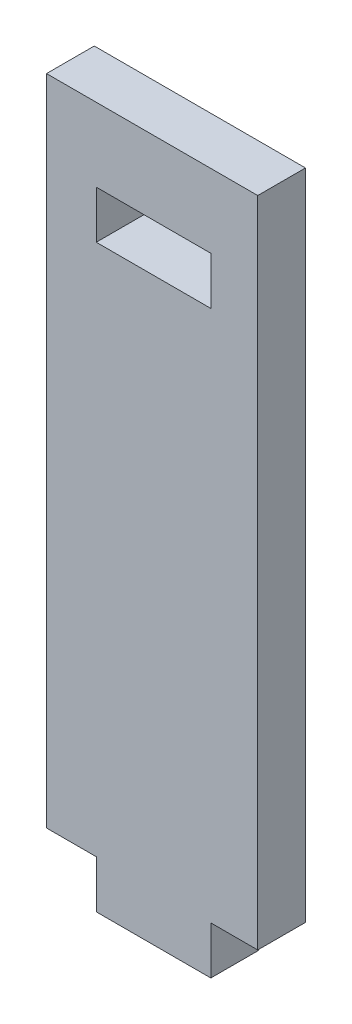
from build123d import *

# Parameters (mm, degrees)
SKETCH1_W           = 12
SKETCH1_H           = 5
BOSS_EXTRUDE1_DEPTH = 5


with BuildPart() as part:
    # Sketch1 → Boss-Extrude1 (new body)
    with BuildSketch(Plane.XY):
        Polygon((-12.27, -15.3125), (-12.27, -20.3125), (-0.27, -20.3125), (-0.27, -15.3125), (4.645, -15.3125), (4.645, 53.127370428), (-17.48, 53.127370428), (-17.48, -15.3125), align=None)
        with Locations((-6.27, 42.929894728)):
            Rectangle(SKETCH1_W, SKETCH1_H, mode=Mode.SUBTRACT)
    extrude(amount=BOSS_EXTRUDE1_DEPTH)


solid = part.part
